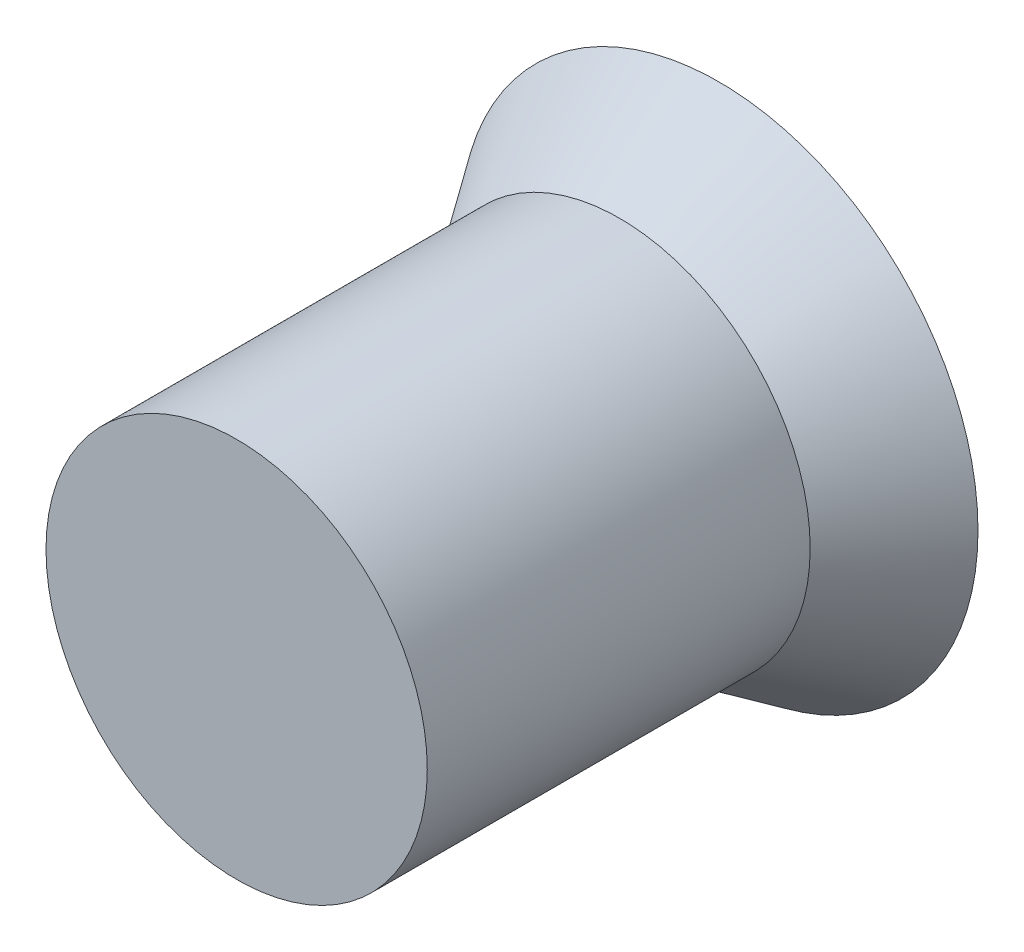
ISO-10303-21;
HEADER;
FILE_DESCRIPTION(('STEP AP214'),'2;1');
FILE_NAME('part.step','',(''),(''),'','','');
FILE_SCHEMA(('AUTOMOTIVE_DESIGN { 1 0 10303 214 1 1 1 1 }'));
ENDSEC;
DATA;
#1=APPLICATION_CONTEXT('core data for automotive mechanical design processes');
#2=APPLICATION_PROTOCOL_DEFINITION('international standard','automotive_design',2000,#1);
#3=PRODUCT_CONTEXT('',#1,'mechanical');
#4=PRODUCT('Part','Part','',(#3));
#5=PRODUCT_RELATED_PRODUCT_CATEGORY('part','',(#4));
#6=PRODUCT_DEFINITION_FORMATION('','',#4);
#7=PRODUCT_DEFINITION_CONTEXT('part definition',#1,'design');
#8=PRODUCT_DEFINITION('design','',#6,#7);
#9=PRODUCT_DEFINITION_SHAPE('','',#8);
#10=(LENGTH_UNIT() NAMED_UNIT(*) SI_UNIT(.MILLI.,.METRE.));
#11=(NAMED_UNIT(*) PLANE_ANGLE_UNIT() SI_UNIT($,.RADIAN.));
#12=(NAMED_UNIT(*) SI_UNIT($,.STERADIAN.) SOLID_ANGLE_UNIT());
#13=UNCERTAINTY_MEASURE_WITH_UNIT(LENGTH_MEASURE(1.E-05),#10,'distance_accuracy_value','');
#14=(GEOMETRIC_REPRESENTATION_CONTEXT(3) GLOBAL_UNCERTAINTY_ASSIGNED_CONTEXT((#13)) GLOBAL_UNIT_ASSIGNED_CONTEXT((#10,
#11,#12)) REPRESENTATION_CONTEXT('',''));
#15=CARTESIAN_POINT('',(0.,0.,0.));
#16=DIRECTION('',(0.,0.,1.));
#17=DIRECTION('',(1.,0.,0.));
#18=AXIS2_PLACEMENT_3D('',#15,#16,#17);
#19=CARTESIAN_POINT('',(0.,0.,-2.35));
#20=DIRECTION('',(0.,0.,1.));
#21=DIRECTION('',(1.,0.,0.));
#22=AXIS2_PLACEMENT_3D('',#19,#20,#21);
#23=CYLINDRICAL_SURFACE('',#22,1.17);
#24=CARTESIAN_POINT('',(0.,0.,-2.35));
#25=DIRECTION('',(0.,0.,1.));
#26=DIRECTION('',(1.,0.,0.));
#27=AXIS2_PLACEMENT_3D('',#24,#25,#26);
#28=CIRCLE('',#27,1.17);
#29=CARTESIAN_POINT('',(1.17,0.,-2.35));
#30=VERTEX_POINT('',#29);
#31=EDGE_CURVE('E46',#30,#30,#28,.F.);
#32=ORIENTED_EDGE('',*,*,#31,.F.);
#33=EDGE_LOOP('',(#32));
#34=FACE_BOUND('',#33,.T.);
#35=CARTESIAN_POINT('',(0.,0.,0.));
#36=DIRECTION('',(0.,0.,1.));
#37=DIRECTION('',(1.,0.,0.));
#38=AXIS2_PLACEMENT_3D('',#35,#36,#37);
#39=CIRCLE('',#38,1.17);
#40=CARTESIAN_POINT('',(1.17,0.,0.));
#41=VERTEX_POINT('',#40);
#42=EDGE_CURVE('E11',#41,#41,#39,.T.);
#43=ORIENTED_EDGE('',*,*,#42,.F.);
#44=EDGE_LOOP('',(#43));
#45=FACE_BOUND('',#44,.T.);
#46=ADVANCED_FACE('F36',(#34,#45),#23,.T.);
#47=CARTESIAN_POINT('',(0.,0.,0.));
#48=DIRECTION('',(0.,0.,1.));
#49=DIRECTION('',(1.,0.,0.));
#50=AXIS2_PLACEMENT_3D('',#47,#48,#49);
#51=PLANE('',#50);
#52=ORIENTED_EDGE('',*,*,#42,.T.);
#53=EDGE_LOOP('',(#52));
#54=FACE_BOUND('',#53,.T.);
#55=ADVANCED_FACE('F69',(#54),#51,.T.);
#56=CARTESIAN_POINT('',(0.,0.,-2.96));
#57=DIRECTION('',(0.,0.,-1.));
#58=DIRECTION('',(-1.,0.,0.));
#59=AXIS2_PLACEMENT_3D('',#56,#57,#58);
#60=PLANE('',#59);
#61=CARTESIAN_POINT('',(0.,0.,-2.96));
#62=DIRECTION('',(0.,0.,-1.));
#63=DIRECTION('',(-1.,0.,0.));
#64=AXIS2_PLACEMENT_3D('',#61,#62,#63);
#65=CIRCLE('',#64,1.59);
#66=CARTESIAN_POINT('',(-1.59,0.,-2.96));
#67=VERTEX_POINT('',#66);
#68=EDGE_CURVE('E42',#67,#67,#65,.T.);
#69=ORIENTED_EDGE('',*,*,#68,.T.);
#70=EDGE_LOOP('',(#69));
#71=FACE_BOUND('',#70,.T.);
#72=ADVANCED_FACE('F59',(#71),#60,.T.);
#73=CARTESIAN_POINT('',(0.,0.,-2.35));
#74=DIRECTION('',(0.,0.,-1.));
#75=DIRECTION('',(-1.,0.,0.));
#76=AXIS2_PLACEMENT_3D('',#73,#74,#75);
#77=CONICAL_SURFACE('',#76,1.17,0.602982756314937);
#78=ORIENTED_EDGE('',*,*,#31,.T.);
#79=EDGE_LOOP('',(#78));
#80=FACE_BOUND('',#79,.T.);
#81=ORIENTED_EDGE('',*,*,#68,.F.);
#82=EDGE_LOOP('',(#81));
#83=FACE_BOUND('',#82,.T.);
#84=ADVANCED_FACE('F68',(#80,#83),#77,.T.);
#85=CLOSED_SHELL('',(#46,#55,#72,#84));
#86=MANIFOLD_SOLID_BREP('B2',#85);
#87=ADVANCED_BREP_SHAPE_REPRESENTATION('',(#18,#86),#14);
#88=SHAPE_DEFINITION_REPRESENTATION(#9,#87);
ENDSEC;
END-ISO-10303-21;
